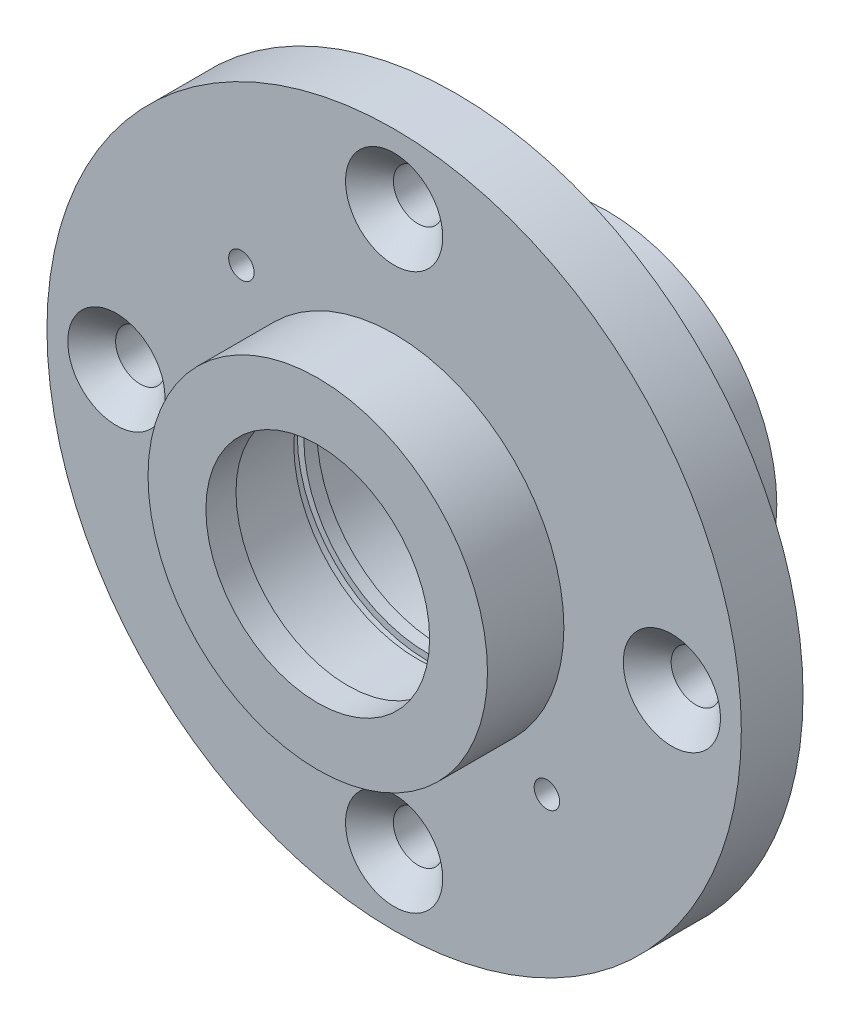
from build123d import *

# Parameters (mm, degrees)
SZKIC1_R                                             = 22
SZKIC1_R_2                                           = 14.5
DODANIE_WYCI_GNI_CIE1_DEPTH                          = 37.5
SZKIC2_R                                             = 45
SZKIC2_R_2                                           = 22
DODANIE_WYCI_GNI_CIE2_DEPTH                          = 8
POG_BIENIE_STO_KOWE_POD_M6_WKR_T_DO_CZ_C_D           = 6.4
POG_BIENIE_STO_KOWE_POD_M6_WKR_T_DO_CZ_C_CSINK_D     = 12.6
POG_BIENIE_STO_KOWE_POD_M6_WKR_T_DO_CZ_C_CSINK_ANGLE = 90
OTW_R_GWINTOWANY_M4X0_71_D                           = 3.3
SZKIC12_R                                            = 17.5
WYTNIJ_WYCI_GNI_CIE1_DEPTH                           = 14.6
SZKIC13_R                                            = 16
WYTNIJ_WYCI_GNI_CIE2_DEPTH                           = 19
SZKIC14_W                                            = 1
SZKIC14_H                                            = 1.6
SZKIC14_W_2                                          = 0.85
SZKIC14_H_2                                          = 1.3
SZKIC15_R                                            = 16.25
WYTNIJ_WYCI_GNI_CIE3_DEPTH                           = 7


with BuildPart() as part:
    # Szkic1 → Dodanie-wyci_gni_cie1 (new body)
    with BuildSketch(Plane.XY):
        Circle(SZKIC1_R)
        Circle(SZKIC1_R_2, mode=Mode.SUBTRACT)
    extrude(amount=DODANIE_WYCI_GNI_CIE1_DEPTH)

    # Szkic2 → Dodanie-wyci_gni_cie2 (add)
    with BuildSketch(Plane.XY.offset(19.6)):
        Circle(SZKIC2_R)
        Circle(SZKIC2_R_2, mode=Mode.SUBTRACT)
    extrude(amount=DODANIE_WYCI_GNI_CIE2_DEPTH)

    # Pog_bienie sto_kowe pod M6 wkr_t do cz_c (through all)
    with Locations(Plane.XY.offset(27.6)):
        with Locations((-36, 0), (0, 36), (36, 0), (0, -36)):
            CounterSinkHole(POG_BIENIE_STO_KOWE_POD_M6_WKR_T_DO_CZ_C_D / 2, POG_BIENIE_STO_KOWE_POD_M6_WKR_T_DO_CZ_C_CSINK_D / 2, counter_sink_angle=POG_BIENIE_STO_KOWE_POD_M6_WKR_T_DO_CZ_C_CSINK_ANGLE)

    # Otw_r gwintowany M4x0.71 (through all)
    with Locations(Plane.XY.offset(37.5)):
        with Locations((-19.798989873, 19.798989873), (19.798989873, -19.798989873)):
            Hole(OTW_R_GWINTOWANY_M4X0_71_D / 2)

    # Szkic12 → Wytnij-wyci_gni_cie1 (cut)
    with BuildSketch(Plane(origin=(0, 0, 0), x_dir=(-1, 0, 0), z_dir=(0, 0, -1))):
        Circle(SZKIC12_R)
    extrude(amount=-WYTNIJ_WYCI_GNI_CIE1_DEPTH, mode=Mode.SUBTRACT)

    # Szkic13 → Wytnij-wyci_gni_cie2 (cut)
    with BuildSketch(Plane(origin=(0, 0, 14.6), x_dir=(-1, 0, 0), z_dir=(0, 0, -1))):
        Circle(SZKIC13_R)
    extrude(amount=-WYTNIJ_WYCI_GNI_CIE2_DEPTH, mode=Mode.SUBTRACT)

    # Szkic14 → Wyci_cie-obr_t1 (revolve, cut)
    with BuildSketch(Plane(origin=(0, 0, 0), x_dir=(1, 0, 0), z_dir=(0, 1, 0))):
        with Locations((-18, -3.8)):
            Rectangle(SZKIC14_W, SZKIC14_H)
        with Locations((-16.425, -23.95)):
            Rectangle(SZKIC14_W_2, SZKIC14_H_2)
    revolve(axis=Axis((0, 0, 0), (0, 0, 1)), mode=Mode.SUBTRACT)

    # Szkic15 → Wytnij-wyci_gni_cie3 (cut)
    with BuildSketch(Plane(origin=(0, 0, 14.6), x_dir=(-1, 0, 0), z_dir=(0, 0, -1))):
        Circle(SZKIC15_R)
    extrude(amount=-WYTNIJ_WYCI_GNI_CIE3_DEPTH, mode=Mode.SUBTRACT)


solid = part.part
